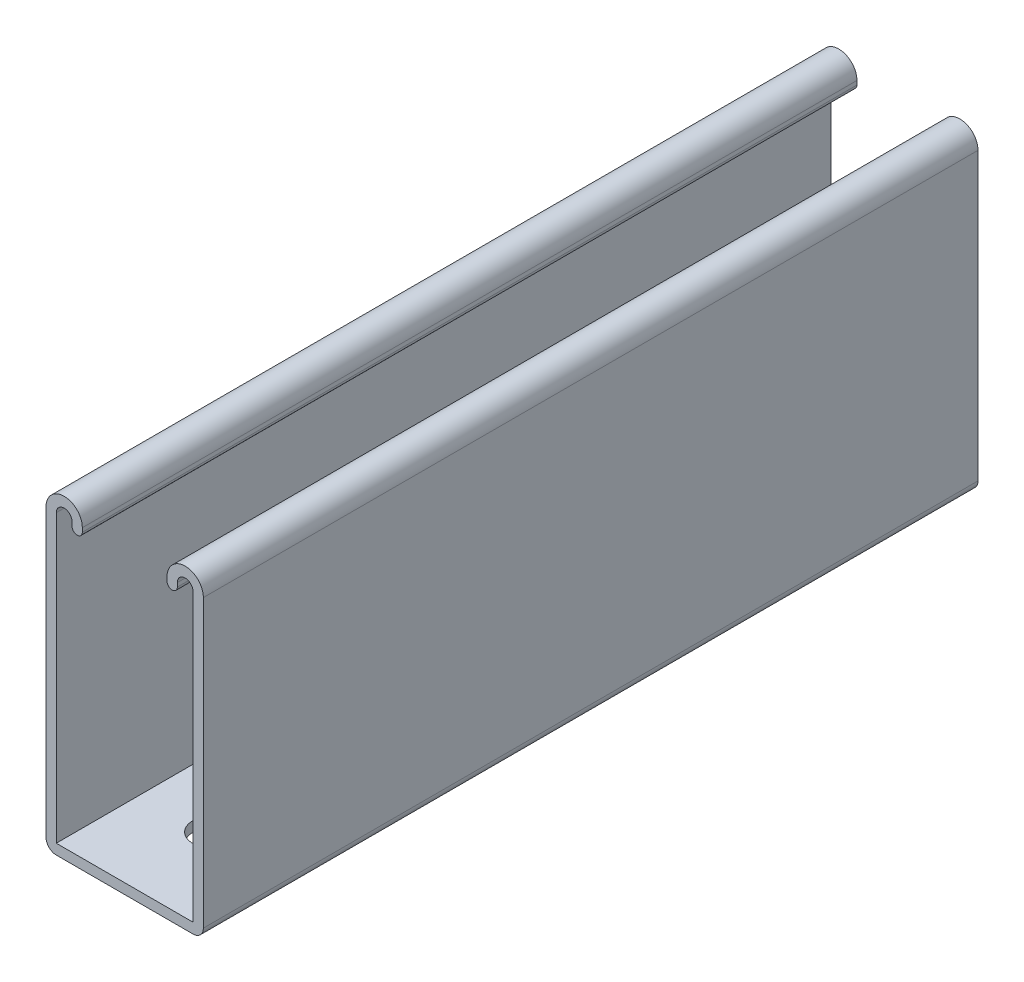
from build123d import *

# Parameters (mm, degrees)
BASE_EXTRUDE_DEPTH = 203.2
SLOT_DEPTH         = 234.945438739
LPATTERN1_COUNT    = 2
LPATTERN1_PITCH    = 101.6


with BuildPart() as part:
    # Sketch1 → Base-Extrude (new body)
    with BuildSketch(Plane.XY):
        with BuildLine():
            Line((-20.6375, 39.6875), (-20.6375, -35.4076))
            ThreePointArc((-20.6375, -35.4076), (-19.848914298, -37.311414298), (-17.9451, -38.1))
            Line((-17.9451, -38.1), (17.9451, -38.1))
            ThreePointArc((17.9451, -38.1), (19.848914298, -37.311414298), (20.6375, -35.4076))
            Line((20.6375, -35.4076), (20.6375, 39.6875))
            ThreePointArc((20.6375, 39.6875), (15.875, 44.45), (11.1125, 39.6875))
            Line((11.1125, 39.6875), (11.1125, 38.65245))
            ThreePointArc((11.1125, 38.65245), (12.4587, 37.30625), (13.8049, 38.65245))
            Line((13.8049, 38.65245), (13.8049, 39.6875))
            ThreePointArc((13.8049, 39.6875), (15.875, 41.7576), (17.9451, 39.6875))
            Line((17.9451, 39.6875), (17.9451, -35.4076))
            Line((17.9451, -35.4076), (-17.9451, -35.4076))
            Line((-17.9451, -35.4076), (-17.9451, 39.6875))
            ThreePointArc((-17.9451, 39.6875), (-15.875, 41.7576), (-13.8049, 39.6875))
            Line((-13.8049, 39.6875), (-13.8049, 38.65245))
            ThreePointArc((-13.8049, 38.65245), (-12.4587, 37.30625), (-11.1125, 38.65245))
            Line((-11.1125, 38.65245), (-11.1125, 39.6875))
            ThreePointArc((-11.1125, 39.6875), (-15.875, 44.45), (-20.6375, 39.6875))
        make_face()
    extrude(amount=BASE_EXTRUDE_DEPTH)

    # Sketch2 → Slot (cut, through all)
    with BuildSketch(Plane(origin=(-0.560706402, -38.1, -14.668313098), x_dir=(1, 0, 0), z_dir=(0, -1, 0))):
        with BuildLine():
            Line((5.720081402, 93.249563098), (5.720081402, 27.368313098))
            ThreePointArc((5.720081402, 27.368313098), (0.560706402, 22.208938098), (-4.598668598, 27.368313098))
            Line((-4.598668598, 27.368313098), (-4.598668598, 93.249563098))
            ThreePointArc((-4.598668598, 93.249563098), (0.560706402, 98.408938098), (5.720081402, 93.249563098))
        make_face()
    slot = extrude(amount=-SLOT_DEPTH, mode=Mode.SUBTRACT)

    # LPattern1: Slot ×2
    with Locations(*[(0, 0, i * LPATTERN1_PITCH) for i in range(1, LPATTERN1_COUNT)]):
        add(slot, mode=Mode.SUBTRACT)


solid = part.part
